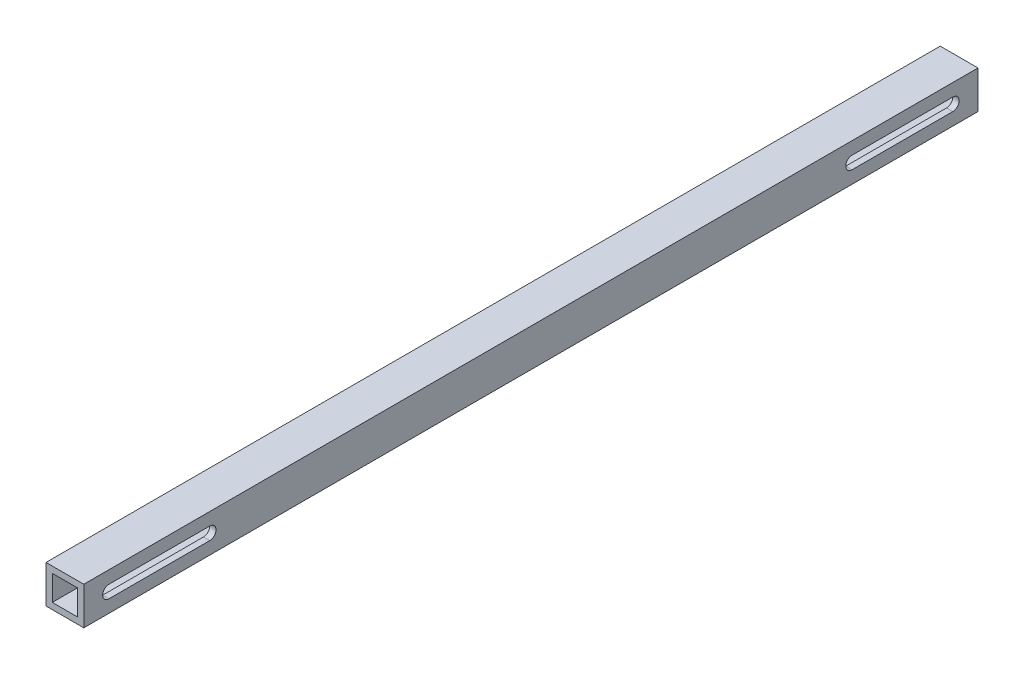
from build123d import *

# Parameters (mm, degrees)
SKETCH1_W           = 19.05
SKETCH1_H           = 19.05
SKETCH1_W_2         = 12.7
SKETCH1_H_2         = 12.7
BOSS_EXTRUDE1_DEPTH = 450.85
CUT_EXTRUDE1_DEPTH  = 452.352800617


with BuildPart() as part:
    # Sketch1 → Boss-Extrude1 (new body)
    with BuildSketch(Plane.XY):
        Rectangle(SKETCH1_W, SKETCH1_H)
        Rectangle(SKETCH1_W_2, SKETCH1_H_2, mode=Mode.SUBTRACT)
    extrude(amount=BOSS_EXTRUDE1_DEPTH)

    # Sketch2 → Cut-Extrude1 (cut, through all)
    with BuildSketch(Plane.ZY.offset(9.525)):
        with BuildLine():
            Line((12.7, 3.175), (63.5, 3.175))
            ThreePointArc((63.5, 3.175), (66.675, 0), (63.5, -3.175))
            Line((63.5, -3.175), (12.7, -3.175))
            ThreePointArc((12.7, -3.175), (9.525, 0), (12.7, 3.175))
        make_face()
        with BuildLine():
            Line((438.15, -3.175), (387.35, -3.175))
            ThreePointArc((387.35, -3.175), (384.175, 0), (387.35, 3.175))
            Line((387.35, 3.175), (438.15, 3.175))
            ThreePointArc((438.15, 3.175), (441.325, 0), (438.15, -3.175))
        make_face()
    extrude(amount=-CUT_EXTRUDE1_DEPTH, mode=Mode.SUBTRACT)


solid = part.part
